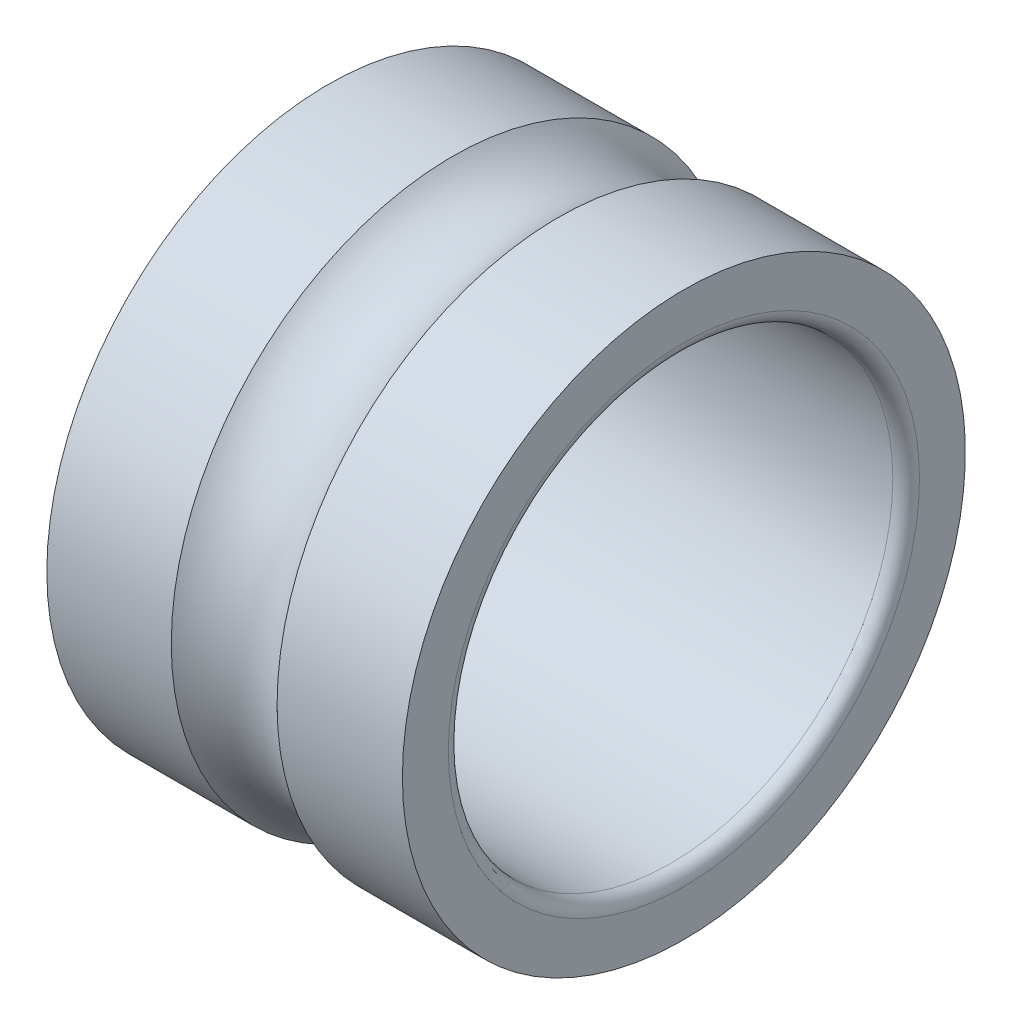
from build123d import *


with BuildPart() as part:
    # Skizze1 → Rotation1 (revolve)
    with BuildSketch(Plane(origin=(0, 0, 0), x_dir=(-1, 0, 0), z_dir=(0, 0, -1)), mode=Mode.PRIVATE) as rotation1_sk:
        with BuildLine():
            Line((-3.354880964, 2.5), (0.345119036, 2.5))
            ThreePointArc((0.345119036, 2.5), (0.451185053, 2.543933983), (0.495119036, 2.65))
            Line((0.495119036, 2.65), (0.495119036, 3.166666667))
            Line((0.495119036, 3.166666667), (-0.904880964, 3.166666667))
            ThreePointArc((-0.904880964, 3.166666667), (-1.5, 2.916666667), (-2.095119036, 3.166666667))
            Line((-2.095119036, 3.166666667), (-3.504880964, 3.166666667))
            Line((-3.504880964, 3.166666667), (-3.504880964, 2.65))
            ThreePointArc((-3.504880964, 2.65), (-3.460946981, 2.543933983), (-3.354880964, 2.5))
        make_face()
    revolve(rotation1_sk.sketch.rotate(Axis((3, 0, 0), (-1, 0, 0)), 270), axis=Axis((3, 0, 0), (-1, 0, 0)))


solid = part.part
